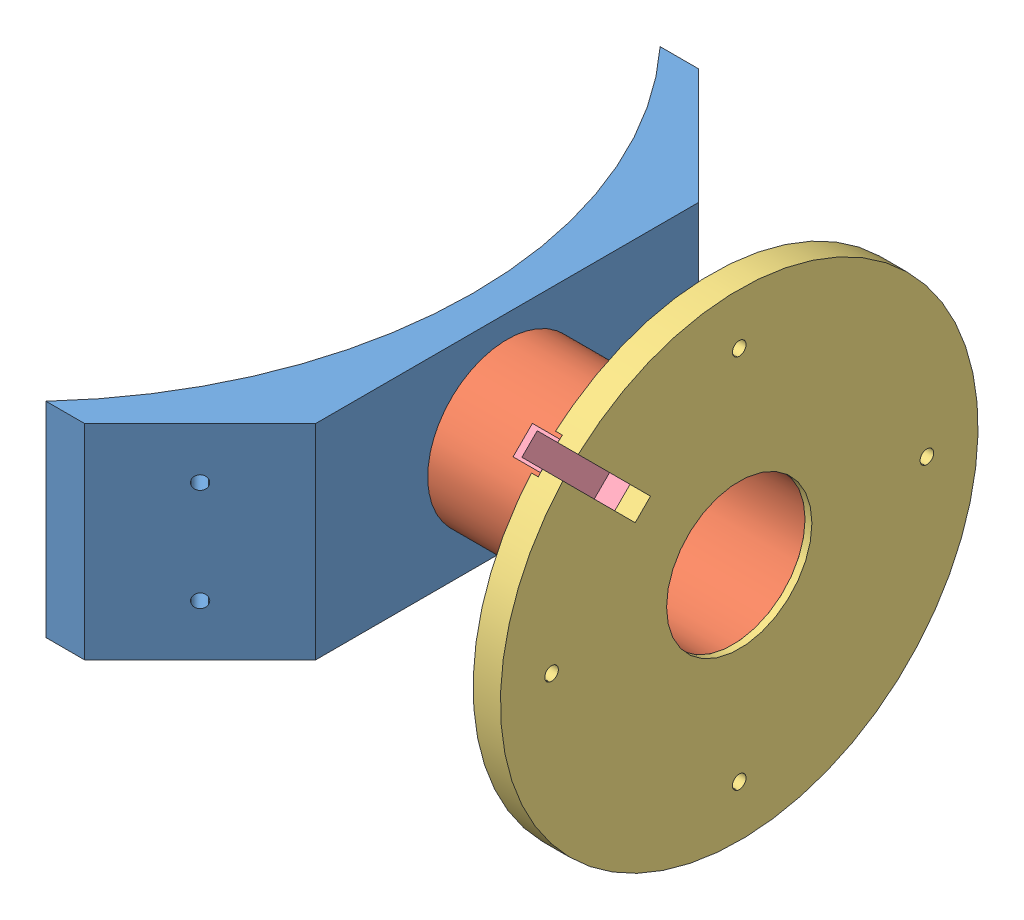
SolidWorks assembly mushroom revised.SLDASM, configuration Default (file format 4700). Lengths in mm.
Overall size (56.58 70 90).
4 component instances, 4 part files, 8 mates.
Components (placement in the parent):
- plate revised-1: plate revised.SLDPRT [Default] at (23.3186 -28.5386 -18.0494) size (22.58 30 90)
- side pmt holder 1 revised-1: side pmt holder 1 revised.SLDPRT [Default] at (25.3186 4.0062 6.7643) x (0 -0.102214 -0.994762) z (0 -0.994762 0.102214) size (23.3 35 23.3)
- side pmt mount full revised-1: side pmt mount full revised.SLDPRT [Default] at (57.3186 -2.2652 -47.8257) size (4 70 70)
- Wire guard revised-1: Wire guard revised.SLDPRT [Default] at (58.3186 40.8105 -3.2685) x (0 -0.707107 0.707107) z (0 -0.707107 -0.707107) size (4 4 15.5)
Mates (geometry in assembly coordinates):
- Concentric1: concentric anti-aligned: cylinder of plate revised-1 through (25.3186 21.2115 -22.8675) axis (1 0 0) radius 11.65; cylinder of side pmt holder 1 revised-1 through (60.3186 21.2115 -22.8675) axis (-1 0 0) radius 11.65
- Coincident1: coincident anti-aligned: plane of plate revised-1 through (25.3186 21.2115 -22.8675) normal (1 0 0); plane of side pmt holder 1 revised-1 through (25.3186 21.2115 -22.8675) normal (-1 0 0)
- Concentric2: concentric aligned: cylinder of side pmt holder 1 revised-1 through (60.3186 21.2115 -22.8675) axis (-1 0 0) radius 11.65; cylinder of side pmt mount full revised-1 through (61.3186 21.2115 -22.8675) axis (-1 0 0) radius 11.65
- Coincident2: coincident anti-aligned: plane of side pmt holder 1 revised-1 through (60.3186 21.2115 -22.8675) normal (1 0 0); plane of side pmt mount full revised-1 through (60.3186 21.2115 -22.8675) normal (-1 0 0)
- Coincident8: coincident anti-aligned: plane of side pmt mount full revised-1 through (58.3186 35.3359 -12.2786) normal (-1 0 0); plane of Wire guard revised-1 through (58.3186 36.3911 -9.1021) normal (1 0 0)
- Coincident13: coincident aligned: plane of side pmt mount full revised-1 through (55.3186 36.4761 -9.8479) normal (0 -0.707107 0.707107); plane of Wire guard revised-1 through (55.3186 36.4761 -9.8479) normal (0 -0.707107 0.707107)
- Coincident14: coincident aligned: plane of side pmt mount full revised-1 through (55.3186 34.2129 -7.62) normal (0 0.707107 0.707107); plane of Wire guard revised-1 through (55.3186 34.2129 -7.62) normal (0 0.707107 0.707107)
- Angle2: planar angle = 2.356194 rad aligned: plane of side pmt mount full revised-1 through (55.3186 36.4761 -9.8479) normal (0 -0.707107 0.707107); plane of plate revised-1 through (27.3186 36.2115 17.1325) normal (0 1 0)
